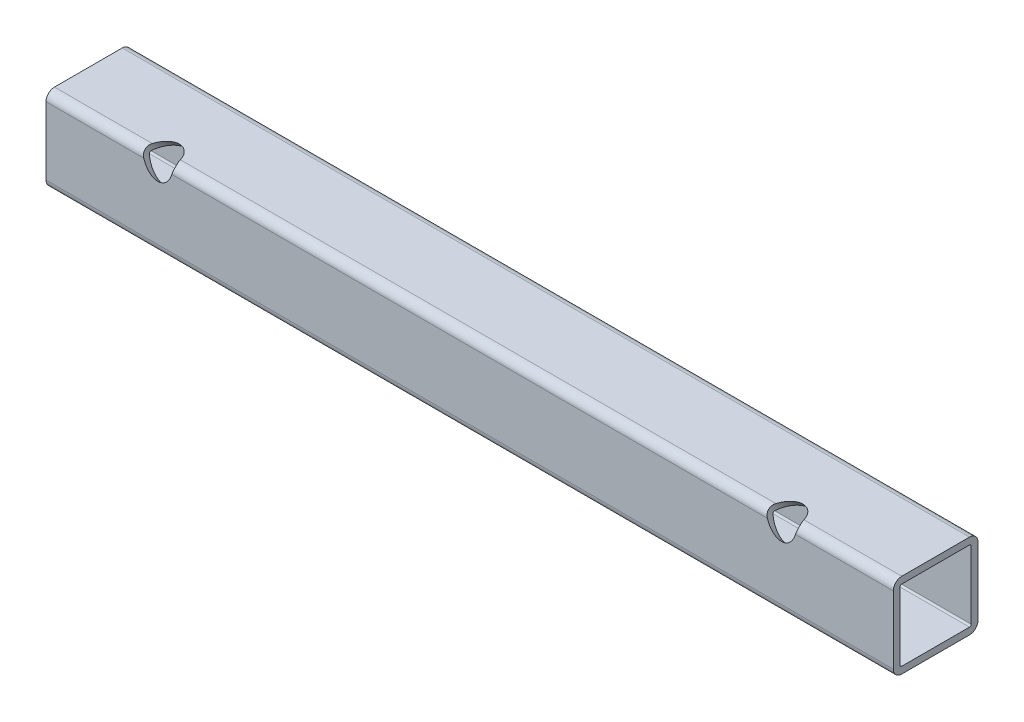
ISO-10303-21;
HEADER;
FILE_DESCRIPTION(('STEP AP214'),'2;1');
FILE_NAME('part.step','',(''),(''),'','','');
FILE_SCHEMA(('AUTOMOTIVE_DESIGN { 1 0 10303 214 1 1 1 1 }'));
ENDSEC;
DATA;
#1=APPLICATION_CONTEXT('core data for automotive mechanical design processes');
#2=APPLICATION_PROTOCOL_DEFINITION('international standard','automotive_design',2000,#1);
#3=PRODUCT_CONTEXT('',#1,'mechanical');
#4=PRODUCT('Part','Part','',(#3));
#5=PRODUCT_RELATED_PRODUCT_CATEGORY('part','',(#4));
#6=PRODUCT_DEFINITION_FORMATION('','',#4);
#7=PRODUCT_DEFINITION_CONTEXT('part definition',#1,'design');
#8=PRODUCT_DEFINITION('design','',#6,#7);
#9=PRODUCT_DEFINITION_SHAPE('','',#8);
#10=(LENGTH_UNIT() NAMED_UNIT(*) SI_UNIT(.MILLI.,.METRE.));
#11=(NAMED_UNIT(*) PLANE_ANGLE_UNIT() SI_UNIT($,.RADIAN.));
#12=(NAMED_UNIT(*) SI_UNIT($,.STERADIAN.) SOLID_ANGLE_UNIT());
#13=UNCERTAINTY_MEASURE_WITH_UNIT(LENGTH_MEASURE(1.E-05),#10,'distance_accuracy_value','');
#14=(GEOMETRIC_REPRESENTATION_CONTEXT(3) GLOBAL_UNCERTAINTY_ASSIGNED_CONTEXT((#13)) GLOBAL_UNIT_ASSIGNED_CONTEXT((#10,
#11,#12)) REPRESENTATION_CONTEXT('',''));
#15=CARTESIAN_POINT('',(0.,0.,0.));
#16=DIRECTION('',(0.,0.,1.));
#17=DIRECTION('',(1.,0.,0.));
#18=AXIS2_PLACEMENT_3D('',#15,#16,#17);
#19=CARTESIAN_POINT('',(125.,10.,10.));
#20=DIRECTION('',(-1.,0.,0.));
#21=DIRECTION('',(0.,0.,1.));
#22=AXIS2_PLACEMENT_3D('',#19,#20,#21);
#23=CYLINDRICAL_SURFACE('',#22,2.5);
#24=DIRECTION('',(-1.,0.,0.));
#25=VECTOR('',#24,1.);
#26=CARTESIAN_POINT('',(125.,12.5,9.99999999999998));
#27=LINE('',#26,#25);
#28=CARTESIAN_POINT('',(87.8617636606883,12.5,9.99999999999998));
#29=VERTEX_POINT('',#28);
#30=CARTESIAN_POINT('',(-87.8617636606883,12.5,9.99999999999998));
#31=VERTEX_POINT('',#30);
#32=EDGE_CURVE('E207',#29,#31,#27,.T.);
#33=ORIENTED_EDGE('',*,*,#32,.T.);
#34=CARTESIAN_POINT('',(-87.8617636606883,9.99999999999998,12.5));
#35=CARTESIAN_POINT('',(-87.8412157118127,10.0680174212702,12.4999928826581));
#36=CARTESIAN_POINT('',(-87.8208214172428,10.1360525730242,12.4972226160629));
#37=CARTESIAN_POINT('',(-87.7807816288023,10.2719220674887,12.4861052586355));
#38=CARTESIAN_POINT('',(-87.7611365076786,10.3397562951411,12.477755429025));
#39=CARTESIAN_POINT('',(-87.7038644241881,10.5430481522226,12.4441746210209));
#40=CARTESIAN_POINT('',(-87.6680741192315,10.6777409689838,12.4104114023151));
#41=CARTESIAN_POINT('',(-87.6048703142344,10.9418845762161,12.3200022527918));
#42=CARTESIAN_POINT('',(-87.5774868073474,11.071315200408,12.2632760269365));
#43=CARTESIAN_POINT('',(-87.5343029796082,11.3199405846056,12.1278395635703));
#44=CARTESIAN_POINT('',(-87.5184728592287,11.4391609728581,12.0491866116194));
#45=CARTESIAN_POINT('',(-87.5009833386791,11.6532294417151,11.879843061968));
#46=CARTESIAN_POINT('',(-87.4982058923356,11.7492971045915,11.7908063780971));
#47=CARTESIAN_POINT('',(-87.5040612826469,11.9261859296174,11.5990054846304));
#48=CARTESIAN_POINT('',(-87.512694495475,12.007006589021,11.4962408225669));
#49=CARTESIAN_POINT('',(-87.5397176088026,12.1472006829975,11.2863136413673));
#50=CARTESIAN_POINT('',(-87.557552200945,12.2075004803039,11.1796930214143));
#51=CARTESIAN_POINT('',(-87.6010903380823,12.3115054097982,10.9600700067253));
#52=CARTESIAN_POINT('',(-87.6268027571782,12.3551917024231,10.8470605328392));
#53=CARTESIAN_POINT('',(-87.6852974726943,12.4270619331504,10.612417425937));
#54=CARTESIAN_POINT('',(-87.7183334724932,12.4545093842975,10.4906213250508));
#55=CARTESIAN_POINT('',(-87.7706121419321,12.4818539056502,10.3069695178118));
#56=CARTESIAN_POINT('',(-87.7884721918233,12.4886643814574,10.2456578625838));
#57=CARTESIAN_POINT('',(-87.824768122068,12.4977341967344,10.1228923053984));
#58=CARTESIAN_POINT('',(-87.8432037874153,12.4999952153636,10.061438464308));
#59=CARTESIAN_POINT('',(-87.8617636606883,12.5,9.99999999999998));
#60=B_SPLINE_CURVE_WITH_KNOTS('',3,(#34,#35,#36,#37,#38,#39,#40,#41,#42,#43,#44,#45,#46,#47,#48,
#49,#50,#51,#52,#53,#54,#55,#56,#57,#58,#59),.UNSPECIFIED.,.F.,.F.,(4,2,2,2,2,2,2,2,2,2,2,2,4),
(0.,0.213047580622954,0.426199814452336,0.854225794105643,1.2837615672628,1.71218548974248,
2.10314834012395,2.49412407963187,2.86386745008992,3.23402886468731,3.6198976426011,
3.81242599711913,4.00488327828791),.UNSPECIFIED.);
#61=CARTESIAN_POINT('',(-87.8617636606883,9.99999999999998,12.5));
#62=VERTEX_POINT('',#61);
#63=EDGE_CURVE('E193',#62,#31,#60,.T.);
#64=ORIENTED_EDGE('',*,*,#63,.F.);
#65=DIRECTION('',(-1.,0.,0.));
#66=VECTOR('',#65,1.);
#67=CARTESIAN_POINT('',(125.,9.99999999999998,12.5));
#68=LINE('',#67,#66);
#69=CARTESIAN_POINT('',(87.8617636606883,9.99999999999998,12.5));
#70=VERTEX_POINT('',#69);
#71=EDGE_CURVE('E205',#70,#62,#68,.T.);
#72=ORIENTED_EDGE('',*,*,#71,.F.);
#73=CARTESIAN_POINT('',(87.8617636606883,12.5,9.99999999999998));
#74=CARTESIAN_POINT('',(87.8412157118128,12.4999928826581,10.0680174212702));
#75=CARTESIAN_POINT('',(87.8208214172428,12.4972226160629,10.1360525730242));
#76=CARTESIAN_POINT('',(87.7807816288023,12.4861052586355,10.2719220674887));
#77=CARTESIAN_POINT('',(87.7611365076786,12.477755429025,10.3397562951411));
#78=CARTESIAN_POINT('',(87.7038644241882,12.4441746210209,10.5430481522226));
#79=CARTESIAN_POINT('',(87.6680741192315,12.4104114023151,10.6777409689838));
#80=CARTESIAN_POINT('',(87.6048703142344,12.3200022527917,10.9418845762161));
#81=CARTESIAN_POINT('',(87.5774868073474,12.2632760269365,11.071315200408));
#82=CARTESIAN_POINT('',(87.5343029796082,12.1278395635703,11.3199405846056));
#83=CARTESIAN_POINT('',(87.5184728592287,12.0491866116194,11.4391609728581));
#84=CARTESIAN_POINT('',(87.5009833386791,11.879843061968,11.6532294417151));
#85=CARTESIAN_POINT('',(87.4982058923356,11.7908063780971,11.7492971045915));
#86=CARTESIAN_POINT('',(87.5040612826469,11.5990054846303,11.9261859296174));
#87=CARTESIAN_POINT('',(87.512694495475,11.4962408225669,12.007006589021));
#88=CARTESIAN_POINT('',(87.5397176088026,11.2863136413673,12.1472006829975));
#89=CARTESIAN_POINT('',(87.557552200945,11.1796930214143,12.2075004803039));
#90=CARTESIAN_POINT('',(87.6010903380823,10.9600700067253,12.3115054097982));
#91=CARTESIAN_POINT('',(87.6268027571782,10.8470605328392,12.3551917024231));
#92=CARTESIAN_POINT('',(87.6852974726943,10.612417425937,12.4270619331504));
#93=CARTESIAN_POINT('',(87.7183334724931,10.4906213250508,12.4545093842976));
#94=CARTESIAN_POINT('',(87.7706121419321,10.3069695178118,12.4818539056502));
#95=CARTESIAN_POINT('',(87.7884721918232,10.2456578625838,12.4886643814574));
#96=CARTESIAN_POINT('',(87.824768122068,10.1228923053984,12.4977341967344));
#97=CARTESIAN_POINT('',(87.8432037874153,10.061438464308,12.4999952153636));
#98=CARTESIAN_POINT('',(87.8617636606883,9.99999999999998,12.5));
#99=B_SPLINE_CURVE_WITH_KNOTS('',3,(#73,#74,#75,#76,#77,#78,#79,#80,#81,#82,#83,#84,#85,#86,#87,
#88,#89,#90,#91,#92,#93,#94,#95,#96,#97,#98),.UNSPECIFIED.,.F.,.F.,(4,2,2,2,2,2,2,2,2,2,2,2,4),
(0.,0.213047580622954,0.426199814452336,0.85422579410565,1.28376156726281,1.7121854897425,
2.10314834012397,2.49412407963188,2.86386745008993,3.23402886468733,3.6198976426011,
3.81242599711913,4.00488327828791),.UNSPECIFIED.);
#100=EDGE_CURVE('E400',#29,#70,#99,.T.);
#101=ORIENTED_EDGE('',*,*,#100,.F.);
#102=EDGE_LOOP('',(#33,#64,#72,#101));
#103=FACE_BOUND('',#102,.T.);
#104=ADVANCED_FACE('F32',(#103),#23,.T.);
#105=CARTESIAN_POINT('',(125.,10.,10.));
#106=DIRECTION('',(-1.,0.,0.));
#107=DIRECTION('',(0.,0.,1.));
#108=AXIS2_PLACEMENT_3D('',#105,#106,#107);
#109=CYLINDRICAL_SURFACE('',#108,0.5);
#110=CARTESIAN_POINT('',(-87.5139103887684,9.99999999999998,10.5));
#111=CARTESIAN_POINT('',(-87.5123413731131,10.0280963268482,10.5000230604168));
#112=CARTESIAN_POINT('',(-87.5107793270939,10.0561876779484,10.497633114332));
#113=CARTESIAN_POINT('',(-87.5078298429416,10.1115710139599,10.4881949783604));
#114=CARTESIAN_POINT('',(-87.5064423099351,10.1388634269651,10.4811493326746));
#115=CARTESIAN_POINT('',(-87.503999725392,10.191907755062,10.4625616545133));
#116=CARTESIAN_POINT('',(-87.5029448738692,10.2176587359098,10.4510169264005));
#117=CARTESIAN_POINT('',(-87.5012867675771,10.2668610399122,10.4237633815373));
#118=CARTESIAN_POINT('',(-87.5006833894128,10.2903129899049,10.4080557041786));
#119=CARTESIAN_POINT('',(-87.499997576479,10.3341624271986,10.3729887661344));
#120=CARTESIAN_POINT('',(-87.499913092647,10.3545716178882,10.3536441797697));
#121=CARTESIAN_POINT('',(-87.5002690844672,10.3918665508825,10.3118105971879));
#122=CARTESIAN_POINT('',(-87.5007096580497,10.4087516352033,10.2893210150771));
#123=CARTESIAN_POINT('',(-87.5020646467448,10.4384791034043,10.2419040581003));
#124=CARTESIAN_POINT('',(-87.5029779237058,10.4513310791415,10.2169826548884));
#125=CARTESIAN_POINT('',(-87.5051760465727,10.4726881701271,10.1653632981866));
#126=CARTESIAN_POINT('',(-87.5064607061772,10.4811954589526,10.1386662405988));
#127=CARTESIAN_POINT('',(-87.5087988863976,10.4915986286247,10.0931841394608));
#128=CARTESIAN_POINT('',(-87.5097902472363,10.4947474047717,10.0746724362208));
#129=CARTESIAN_POINT('',(-87.5118241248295,10.4989477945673,10.0374429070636));
#130=CARTESIAN_POINT('',(-87.5128665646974,10.5000024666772,10.0187254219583));
#131=CARTESIAN_POINT('',(-87.5139103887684,10.5,9.99999999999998));
#132=B_SPLINE_CURVE_WITH_KNOTS('',3,(#110,#111,#112,#113,#114,#115,#116,#117,#118,#119,#120,
#121,#122,#123,#124,#125,#126,#127,#128,#129,#130,#131),.UNSPECIFIED.,.F.,.F.,(4,2,2,2,2,2,2,2,
2,2,4),(0.,0.084311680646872,0.168577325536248,0.252893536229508,0.337186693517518,
0.421146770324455,0.50512250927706,0.588896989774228,0.672629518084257,0.728930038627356,
0.785148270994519),.UNSPECIFIED.);
#133=CARTESIAN_POINT('',(-87.5139103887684,9.99999999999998,10.5));
#134=VERTEX_POINT('',#133);
#135=CARTESIAN_POINT('',(-87.5139103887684,10.5,9.99999999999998));
#136=VERTEX_POINT('',#135);
#137=EDGE_CURVE('E429',#134,#136,#132,.T.);
#138=ORIENTED_EDGE('',*,*,#137,.T.);
#139=DIRECTION('',(-1.,0.,0.));
#140=VECTOR('',#139,1.);
#141=CARTESIAN_POINT('',(125.,10.5,9.99999999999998));
#142=LINE('',#141,#140);
#143=CARTESIAN_POINT('',(87.5139103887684,10.5,9.99999999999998));
#144=VERTEX_POINT('',#143);
#145=EDGE_CURVE('E320',#144,#136,#142,.T.);
#146=ORIENTED_EDGE('',*,*,#145,.F.);
#147=CARTESIAN_POINT('',(87.5139103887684,10.5,9.99999999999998));
#148=CARTESIAN_POINT('',(87.5123413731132,10.5000230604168,10.0280963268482));
#149=CARTESIAN_POINT('',(87.5107793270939,10.497633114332,10.0561876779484));
#150=CARTESIAN_POINT('',(87.5078298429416,10.4881949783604,10.1115710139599));
#151=CARTESIAN_POINT('',(87.5064423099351,10.4811493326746,10.1388634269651));
#152=CARTESIAN_POINT('',(87.503999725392,10.4625616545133,10.191907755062));
#153=CARTESIAN_POINT('',(87.5029448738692,10.4510169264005,10.2176587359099));
#154=CARTESIAN_POINT('',(87.5012867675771,10.4237633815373,10.2668610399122));
#155=CARTESIAN_POINT('',(87.5006833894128,10.4080557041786,10.2903129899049));
#156=CARTESIAN_POINT('',(87.499997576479,10.3729887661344,10.3341624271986));
#157=CARTESIAN_POINT('',(87.499913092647,10.3536441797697,10.3545716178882));
#158=CARTESIAN_POINT('',(87.5002690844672,10.3118105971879,10.3918665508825));
#159=CARTESIAN_POINT('',(87.5007096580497,10.2893210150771,10.4087516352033));
#160=CARTESIAN_POINT('',(87.5020646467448,10.2419040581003,10.4384791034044));
#161=CARTESIAN_POINT('',(87.5029779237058,10.2169826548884,10.4513310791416));
#162=CARTESIAN_POINT('',(87.5051760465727,10.1653632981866,10.4726881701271));
#163=CARTESIAN_POINT('',(87.5064607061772,10.1386662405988,10.4811954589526));
#164=CARTESIAN_POINT('',(87.5087988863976,10.0931841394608,10.4915986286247));
#165=CARTESIAN_POINT('',(87.5097902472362,10.0746724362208,10.4947474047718));
#166=CARTESIAN_POINT('',(87.5118241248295,10.0374429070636,10.4989477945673));
#167=CARTESIAN_POINT('',(87.5128665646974,10.0187254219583,10.5000024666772));
#168=CARTESIAN_POINT('',(87.5139103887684,9.99999999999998,10.5));
#169=B_SPLINE_CURVE_WITH_KNOTS('',3,(#147,#148,#149,#150,#151,#152,#153,#154,#155,#156,#157,
#158,#159,#160,#161,#162,#163,#164,#165,#166,#167,#168),.UNSPECIFIED.,.F.,.F.,(4,2,2,2,2,2,2,2,
2,2,4),(0.,0.084311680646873,0.168577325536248,0.252893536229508,0.337186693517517,
0.421146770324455,0.505122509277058,0.588896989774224,0.672629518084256,0.728930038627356,
0.785148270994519),.UNSPECIFIED.);
#170=CARTESIAN_POINT('',(87.5139103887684,9.99999999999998,10.5));
#171=VERTEX_POINT('',#170);
#172=EDGE_CURVE('E369',#144,#171,#169,.T.);
#173=ORIENTED_EDGE('',*,*,#172,.T.);
#174=DIRECTION('',(-1.,0.,0.));
#175=VECTOR('',#174,1.);
#176=CARTESIAN_POINT('',(125.,9.99999999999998,10.5));
#177=LINE('',#176,#175);
#178=EDGE_CURVE('E292',#171,#134,#177,.T.);
#179=ORIENTED_EDGE('',*,*,#178,.T.);
#180=EDGE_LOOP('',(#138,#146,#173,#179));
#181=FACE_BOUND('',#180,.T.);
#182=ADVANCED_FACE('F428',(#181),#109,.F.);
#183=CARTESIAN_POINT('',(125.,12.5,9.99999999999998));
#184=VERTEX_POINT('',#183);
#185=CARTESIAN_POINT('',(96.1382363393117,12.5,9.99999999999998));
#186=VERTEX_POINT('',#185);
#187=EDGE_CURVE('E221',#184,#186,#27,.T.);
#188=ORIENTED_EDGE('',*,*,#187,.T.);
#189=CARTESIAN_POINT('',(96.1382363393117,9.99999999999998,12.5));
#190=CARTESIAN_POINT('',(96.1587842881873,10.0680174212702,12.4999928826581));
#191=CARTESIAN_POINT('',(96.1791785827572,10.1360525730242,12.4972226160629));
#192=CARTESIAN_POINT('',(96.2192183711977,10.2719220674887,12.4861052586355));
#193=CARTESIAN_POINT('',(96.2388634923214,10.3397562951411,12.477755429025));
#194=CARTESIAN_POINT('',(96.2961355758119,10.5430481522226,12.4441746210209));
#195=CARTESIAN_POINT('',(96.3319258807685,10.6777409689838,12.4104114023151));
#196=CARTESIAN_POINT('',(96.3951296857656,10.9418845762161,12.3200022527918));
#197=CARTESIAN_POINT('',(96.4225131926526,11.071315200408,12.2632760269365));
#198=CARTESIAN_POINT('',(96.4656970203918,11.3199405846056,12.1278395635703));
#199=CARTESIAN_POINT('',(96.4815271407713,11.4391609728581,12.0491866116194));
#200=CARTESIAN_POINT('',(96.4990166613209,11.6532294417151,11.879843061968));
#201=CARTESIAN_POINT('',(96.5017941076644,11.7492971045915,11.7908063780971));
#202=CARTESIAN_POINT('',(96.4959387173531,11.9261859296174,11.5990054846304));
#203=CARTESIAN_POINT('',(96.487305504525,12.007006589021,11.4962408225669));
#204=CARTESIAN_POINT('',(96.4602823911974,12.1472006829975,11.2863136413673));
#205=CARTESIAN_POINT('',(96.442447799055,12.2075004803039,11.1796930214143));
#206=CARTESIAN_POINT('',(96.3989096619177,12.3115054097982,10.9600700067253));
#207=CARTESIAN_POINT('',(96.3731972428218,12.3551917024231,10.8470605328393));
#208=CARTESIAN_POINT('',(96.3147025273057,12.4270619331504,10.612417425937));
#209=CARTESIAN_POINT('',(96.2816665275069,12.4545093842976,10.4906213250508));
#210=CARTESIAN_POINT('',(96.2293878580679,12.4818539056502,10.3069695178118));
#211=CARTESIAN_POINT('',(96.2115278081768,12.4886643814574,10.2456578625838));
#212=CARTESIAN_POINT('',(96.175231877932,12.4977341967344,10.1228923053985));
#213=CARTESIAN_POINT('',(96.1567962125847,12.4999952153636,10.0614384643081));
#214=CARTESIAN_POINT('',(96.1382363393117,12.5,9.99999999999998));
#215=B_SPLINE_CURVE_WITH_KNOTS('',3,(#189,#190,#191,#192,#193,#194,#195,#196,#197,#198,#199,
#200,#201,#202,#203,#204,#205,#206,#207,#208,#209,#210,#211,#212,#213,#214),.UNSPECIFIED.,.F.,
.F.,(4,2,2,2,2,2,2,2,2,2,2,2,4),(0.,0.213047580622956,0.426199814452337,0.854225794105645,
1.2837615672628,1.71218548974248,2.10314834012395,2.49412407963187,2.86386745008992,
3.23402886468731,3.61989764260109,3.81242599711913,4.00488327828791),.UNSPECIFIED.);
#216=CARTESIAN_POINT('',(96.1382363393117,9.99999999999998,12.5));
#217=VERTEX_POINT('',#216);
#218=EDGE_CURVE('E394',#217,#186,#215,.T.);
#219=ORIENTED_EDGE('',*,*,#218,.F.);
#220=CARTESIAN_POINT('',(125.,9.99999999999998,12.5));
#221=VERTEX_POINT('',#220);
#222=EDGE_CURVE('E213',#221,#217,#68,.T.);
#223=ORIENTED_EDGE('',*,*,#222,.F.);
#224=CARTESIAN_POINT('',(125.,10.,10.));
#225=DIRECTION('',(1.,0.,0.));
#226=DIRECTION('',(0.,0.,-1.));
#227=AXIS2_PLACEMENT_3D('',#224,#225,#226);
#228=CIRCLE('',#227,2.5);
#229=EDGE_CURVE('E286',#184,#221,#228,.T.);
#230=ORIENTED_EDGE('',*,*,#229,.F.);
#231=EDGE_LOOP('',(#188,#219,#223,#230));
#232=FACE_BOUND('',#231,.T.);
#233=ADVANCED_FACE('F470',(#232),#23,.T.);
#234=CARTESIAN_POINT('',(96.4860896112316,9.99999999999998,10.5));
#235=CARTESIAN_POINT('',(96.4876586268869,10.0280963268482,10.5000230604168));
#236=CARTESIAN_POINT('',(96.4892206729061,10.0561876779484,10.497633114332));
#237=CARTESIAN_POINT('',(96.4921701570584,10.1115710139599,10.4881949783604));
#238=CARTESIAN_POINT('',(96.4935576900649,10.1388634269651,10.4811493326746));
#239=CARTESIAN_POINT('',(96.496000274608,10.191907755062,10.4625616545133));
#240=CARTESIAN_POINT('',(96.4970551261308,10.2176587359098,10.4510169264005));
#241=CARTESIAN_POINT('',(96.4987132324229,10.2668610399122,10.4237633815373));
#242=CARTESIAN_POINT('',(96.4993166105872,10.2903129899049,10.4080557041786));
#243=CARTESIAN_POINT('',(96.500002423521,10.3341624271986,10.3729887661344));
#244=CARTESIAN_POINT('',(96.500086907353,10.3545716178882,10.3536441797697));
#245=CARTESIAN_POINT('',(96.4997309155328,10.3918665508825,10.3118105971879));
#246=CARTESIAN_POINT('',(96.4992903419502,10.4087516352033,10.2893210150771));
#247=CARTESIAN_POINT('',(96.4979353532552,10.4384791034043,10.2419040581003));
#248=CARTESIAN_POINT('',(96.4970220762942,10.4513310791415,10.2169826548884));
#249=CARTESIAN_POINT('',(96.4948239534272,10.4726881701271,10.1653632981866));
#250=CARTESIAN_POINT('',(96.4935392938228,10.4811954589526,10.1386662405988));
#251=CARTESIAN_POINT('',(96.4912011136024,10.4915986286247,10.0931841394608));
#252=CARTESIAN_POINT('',(96.4902097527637,10.4947474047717,10.0746724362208));
#253=CARTESIAN_POINT('',(96.4881758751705,10.4989477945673,10.0374429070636));
#254=CARTESIAN_POINT('',(96.4871334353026,10.5000024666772,10.0187254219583));
#255=CARTESIAN_POINT('',(96.4860896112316,10.5,9.99999999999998));
#256=B_SPLINE_CURVE_WITH_KNOTS('',3,(#234,#235,#236,#237,#238,#239,#240,#241,#242,#243,#244,
#245,#246,#247,#248,#249,#250,#251,#252,#253,#254,#255),.UNSPECIFIED.,.F.,.F.,(4,2,2,2,2,2,2,2,
2,2,4),(0.,0.084311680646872,0.168577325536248,0.25289353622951,0.337186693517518,
0.421146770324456,0.50512250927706,0.588896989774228,0.672629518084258,0.728930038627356,
0.785148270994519),.UNSPECIFIED.);
#257=CARTESIAN_POINT('',(96.4860896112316,9.99999999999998,10.5));
#258=VERTEX_POINT('',#257);
#259=CARTESIAN_POINT('',(96.4860896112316,10.5,9.99999999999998));
#260=VERTEX_POINT('',#259);
#261=EDGE_CURVE('E377',#258,#260,#256,.T.);
#262=ORIENTED_EDGE('',*,*,#261,.T.);
#263=CARTESIAN_POINT('',(125.,10.5,9.99999999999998));
#264=VERTEX_POINT('',#263);
#265=EDGE_CURVE('E317',#264,#260,#142,.T.);
#266=ORIENTED_EDGE('',*,*,#265,.F.);
#267=CARTESIAN_POINT('',(125.,10.,10.));
#268=DIRECTION('',(1.,0.,0.));
#269=DIRECTION('',(0.,0.,-1.));
#270=AXIS2_PLACEMENT_3D('',#267,#268,#269);
#271=CIRCLE('',#270,0.5);
#272=CARTESIAN_POINT('',(125.,9.99999999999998,10.5));
#273=VERTEX_POINT('',#272);
#274=EDGE_CURVE('E325',#264,#273,#271,.T.);
#275=ORIENTED_EDGE('',*,*,#274,.T.);
#276=EDGE_CURVE('E276',#273,#258,#177,.T.);
#277=ORIENTED_EDGE('',*,*,#276,.T.);
#278=EDGE_LOOP('',(#262,#266,#275,#277));
#279=FACE_BOUND('',#278,.T.);
#280=ADVANCED_FACE('F410',(#279),#109,.F.);
#281=CARTESIAN_POINT('',(125.,-10.,10.));
#282=DIRECTION('',(1.,0.,0.));
#283=DIRECTION('',(0.,0.,-1.));
#284=AXIS2_PLACEMENT_3D('',#281,#282,#283);
#285=PLANE('',#284);
#286=CARTESIAN_POINT('',(125.,-10.,10.));
#287=DIRECTION('',(1.,0.,0.));
#288=DIRECTION('',(0.,0.,-1.));
#289=AXIS2_PLACEMENT_3D('',#286,#287,#288);
#290=CIRCLE('',#289,2.5);
#291=CARTESIAN_POINT('',(125.,-9.99999999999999,12.5));
#292=VERTEX_POINT('',#291);
#293=CARTESIAN_POINT('',(125.,-12.5,9.99999999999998));
#294=VERTEX_POINT('',#293);
#295=EDGE_CURVE('E264',#292,#294,#290,.T.);
#296=ORIENTED_EDGE('',*,*,#295,.T.);
#297=DIRECTION('',(0.,0.,-1.));
#298=VECTOR('',#297,1.);
#299=CARTESIAN_POINT('',(125.,-12.5,9.99999999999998));
#300=LINE('',#299,#298);
#301=CARTESIAN_POINT('',(125.,-12.5,-9.99999999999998));
#302=VERTEX_POINT('',#301);
#303=EDGE_CURVE('E269',#294,#302,#300,.T.);
#304=ORIENTED_EDGE('',*,*,#303,.T.);
#305=CARTESIAN_POINT('',(125.,-10.,-10.));
#306=DIRECTION('',(1.,0.,0.));
#307=DIRECTION('',(0.,0.,-1.));
#308=AXIS2_PLACEMENT_3D('',#305,#306,#307);
#309=CIRCLE('',#308,2.5);
#310=CARTESIAN_POINT('',(125.,-9.99999999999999,-12.5));
#311=VERTEX_POINT('',#310);
#312=EDGE_CURVE('E240',#302,#311,#309,.T.);
#313=ORIENTED_EDGE('',*,*,#312,.T.);
#314=DIRECTION('',(0.,1.,0.));
#315=VECTOR('',#314,1.);
#316=CARTESIAN_POINT('',(125.,9.99999999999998,-12.5));
#317=LINE('',#316,#315);
#318=CARTESIAN_POINT('',(125.,9.99999999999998,-12.5));
#319=VERTEX_POINT('',#318);
#320=EDGE_CURVE('E280',#311,#319,#317,.T.);
#321=ORIENTED_EDGE('',*,*,#320,.T.);
#322=CARTESIAN_POINT('',(125.,10.,-10.));
#323=DIRECTION('',(1.,0.,0.));
#324=DIRECTION('',(0.,0.,1.));
#325=AXIS2_PLACEMENT_3D('',#322,#323,#324);
#326=CIRCLE('',#325,2.5);
#327=CARTESIAN_POINT('',(125.,12.5,-9.99999999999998));
#328=VERTEX_POINT('',#327);
#329=EDGE_CURVE('E282',#319,#328,#326,.T.);
#330=ORIENTED_EDGE('',*,*,#329,.T.);
#331=DIRECTION('',(0.,0.,1.));
#332=VECTOR('',#331,1.);
#333=CARTESIAN_POINT('',(125.,12.5,9.99999999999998));
#334=LINE('',#333,#332);
#335=EDGE_CURVE('E284',#328,#184,#334,.T.);
#336=ORIENTED_EDGE('',*,*,#335,.T.);
#337=ORIENTED_EDGE('',*,*,#229,.T.);
#338=DIRECTION('',(0.,-1.,0.));
#339=VECTOR('',#338,1.);
#340=CARTESIAN_POINT('',(125.,9.99999999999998,12.5));
#341=LINE('',#340,#339);
#342=EDGE_CURVE('E288',#221,#292,#341,.T.);
#343=ORIENTED_EDGE('',*,*,#342,.T.);
#344=EDGE_LOOP('',(#296,#304,#313,#321,#330,#336,#337,#343));
#345=FACE_BOUND('',#344,.T.);
#346=DIRECTION('',(0.,-1.,0.));
#347=VECTOR('',#346,1.);
#348=CARTESIAN_POINT('',(125.,9.99999999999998,10.5));
#349=LINE('',#348,#347);
#350=CARTESIAN_POINT('',(125.,-10.,10.5));
#351=VERTEX_POINT('',#350);
#352=EDGE_CURVE('E361',#273,#351,#349,.T.);
#353=ORIENTED_EDGE('',*,*,#352,.F.);
#354=ORIENTED_EDGE('',*,*,#274,.F.);
#355=DIRECTION('',(0.,0.,1.));
#356=VECTOR('',#355,1.);
#357=CARTESIAN_POINT('',(125.,10.5,9.99999999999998));
#358=LINE('',#357,#356);
#359=CARTESIAN_POINT('',(125.,10.5,-9.99999999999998));
#360=VERTEX_POINT('',#359);
#361=EDGE_CURVE('E348',#360,#264,#358,.T.);
#362=ORIENTED_EDGE('',*,*,#361,.F.);
#363=CARTESIAN_POINT('',(125.,10.,-10.));
#364=DIRECTION('',(1.,0.,0.));
#365=DIRECTION('',(0.,0.,1.));
#366=AXIS2_PLACEMENT_3D('',#363,#364,#365);
#367=CIRCLE('',#366,0.5);
#368=CARTESIAN_POINT('',(125.,9.99999999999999,-10.5));
#369=VERTEX_POINT('',#368);
#370=EDGE_CURVE('E350',#369,#360,#367,.T.);
#371=ORIENTED_EDGE('',*,*,#370,.F.);
#372=DIRECTION('',(0.,1.,0.));
#373=VECTOR('',#372,1.);
#374=CARTESIAN_POINT('',(125.,9.99999999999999,-10.5));
#375=LINE('',#374,#373);
#376=CARTESIAN_POINT('',(125.,-9.99999999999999,-10.5));
#377=VERTEX_POINT('',#376);
#378=EDGE_CURVE('E353',#377,#369,#375,.T.);
#379=ORIENTED_EDGE('',*,*,#378,.F.);
#380=CARTESIAN_POINT('',(125.,-10.,-10.));
#381=DIRECTION('',(1.,0.,0.));
#382=DIRECTION('',(0.,0.,-1.));
#383=AXIS2_PLACEMENT_3D('',#380,#381,#382);
#384=CIRCLE('',#383,0.499999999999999);
#385=CARTESIAN_POINT('',(125.,-10.5,-10.));
#386=VERTEX_POINT('',#385);
#387=EDGE_CURVE('E355',#386,#377,#384,.T.);
#388=ORIENTED_EDGE('',*,*,#387,.F.);
#389=DIRECTION('',(0.,0.,-1.));
#390=VECTOR('',#389,1.);
#391=CARTESIAN_POINT('',(125.,-10.5,9.99999999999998));
#392=LINE('',#391,#390);
#393=CARTESIAN_POINT('',(125.,-10.5,9.99999999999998));
#394=VERTEX_POINT('',#393);
#395=EDGE_CURVE('E357',#394,#386,#392,.T.);
#396=ORIENTED_EDGE('',*,*,#395,.F.);
#397=CARTESIAN_POINT('',(125.,-10.,10.));
#398=DIRECTION('',(1.,0.,0.));
#399=DIRECTION('',(0.,0.,-1.));
#400=AXIS2_PLACEMENT_3D('',#397,#398,#399);
#401=CIRCLE('',#400,0.5);
#402=EDGE_CURVE('E359',#351,#394,#401,.T.);
#403=ORIENTED_EDGE('',*,*,#402,.F.);
#404=EDGE_LOOP('',(#353,#354,#362,#371,#379,#388,#396,#403));
#405=FACE_BOUND('',#404,.T.);
#406=ADVANCED_FACE('F419',(#345,#405),#285,.T.);
#407=CARTESIAN_POINT('',(-125.,-10.,10.));
#408=DIRECTION('',(1.,0.,0.));
#409=DIRECTION('',(0.,0.,-1.));
#410=AXIS2_PLACEMENT_3D('',#407,#408,#409);
#411=PLANE('',#410);
#412=CARTESIAN_POINT('',(-125.,-10.,10.));
#413=DIRECTION('',(1.,0.,0.));
#414=DIRECTION('',(0.,0.,-1.));
#415=AXIS2_PLACEMENT_3D('',#412,#413,#414);
#416=CIRCLE('',#415,2.5);
#417=CARTESIAN_POINT('',(-125.,-9.99999999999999,12.5));
#418=VERTEX_POINT('',#417);
#419=CARTESIAN_POINT('',(-125.,-12.5,9.99999999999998));
#420=VERTEX_POINT('',#419);
#421=EDGE_CURVE('E253',#418,#420,#416,.T.);
#422=ORIENTED_EDGE('',*,*,#421,.F.);
#423=DIRECTION('',(0.,-1.,0.));
#424=VECTOR('',#423,1.);
#425=CARTESIAN_POINT('',(-125.,9.99999999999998,12.5));
#426=LINE('',#425,#424);
#427=CARTESIAN_POINT('',(-125.,9.99999999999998,12.5));
#428=VERTEX_POINT('',#427);
#429=EDGE_CURVE('E263',#428,#418,#426,.T.);
#430=ORIENTED_EDGE('',*,*,#429,.F.);
#431=CARTESIAN_POINT('',(-125.,10.,10.));
#432=DIRECTION('',(1.,0.,0.));
#433=DIRECTION('',(0.,0.,-1.));
#434=AXIS2_PLACEMENT_3D('',#431,#432,#433);
#435=CIRCLE('',#434,2.5);
#436=CARTESIAN_POINT('',(-125.,12.5,9.99999999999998));
#437=VERTEX_POINT('',#436);
#438=EDGE_CURVE('E261',#437,#428,#435,.T.);
#439=ORIENTED_EDGE('',*,*,#438,.F.);
#440=DIRECTION('',(0.,0.,1.));
#441=VECTOR('',#440,1.);
#442=CARTESIAN_POINT('',(-125.,12.5,9.99999999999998));
#443=LINE('',#442,#441);
#444=CARTESIAN_POINT('',(-125.,12.5,-9.99999999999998));
#445=VERTEX_POINT('',#444);
#446=EDGE_CURVE('E258',#445,#437,#443,.T.);
#447=ORIENTED_EDGE('',*,*,#446,.F.);
#448=CARTESIAN_POINT('',(-125.,10.,-10.));
#449=DIRECTION('',(1.,0.,0.));
#450=DIRECTION('',(0.,0.,1.));
#451=AXIS2_PLACEMENT_3D('',#448,#449,#450);
#452=CIRCLE('',#451,2.5);
#453=CARTESIAN_POINT('',(-125.,9.99999999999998,-12.5));
#454=VERTEX_POINT('',#453);
#455=EDGE_CURVE('E251',#454,#445,#452,.T.);
#456=ORIENTED_EDGE('',*,*,#455,.F.);
#457=DIRECTION('',(0.,1.,0.));
#458=VECTOR('',#457,1.);
#459=CARTESIAN_POINT('',(-125.,9.99999999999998,-12.5));
#460=LINE('',#459,#458);
#461=CARTESIAN_POINT('',(-125.,-9.99999999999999,-12.5));
#462=VERTEX_POINT('',#461);
#463=EDGE_CURVE('E249',#462,#454,#460,.T.);
#464=ORIENTED_EDGE('',*,*,#463,.F.);
#465=CARTESIAN_POINT('',(-125.,-10.,-10.));
#466=DIRECTION('',(1.,0.,0.));
#467=DIRECTION('',(0.,0.,-1.));
#468=AXIS2_PLACEMENT_3D('',#465,#466,#467);
#469=CIRCLE('',#468,2.5);
#470=CARTESIAN_POINT('',(-125.,-12.5,-9.99999999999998));
#471=VERTEX_POINT('',#470);
#472=EDGE_CURVE('E239',#471,#462,#469,.T.);
#473=ORIENTED_EDGE('',*,*,#472,.F.);
#474=DIRECTION('',(0.,0.,-1.));
#475=VECTOR('',#474,1.);
#476=CARTESIAN_POINT('',(-125.,-12.5,9.99999999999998));
#477=LINE('',#476,#475);
#478=EDGE_CURVE('E247',#420,#471,#477,.T.);
#479=ORIENTED_EDGE('',*,*,#478,.F.);
#480=EDGE_LOOP('',(#422,#430,#439,#447,#456,#464,#473,#479));
#481=FACE_BOUND('',#480,.T.);
#482=CARTESIAN_POINT('',(-125.,10.,10.));
#483=DIRECTION('',(1.,0.,0.));
#484=DIRECTION('',(0.,0.,-1.));
#485=AXIS2_PLACEMENT_3D('',#482,#483,#484);
#486=CIRCLE('',#485,0.5);
#487=CARTESIAN_POINT('',(-125.,10.5,9.99999999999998));
#488=VERTEX_POINT('',#487);
#489=CARTESIAN_POINT('',(-125.,9.99999999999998,10.5));
#490=VERTEX_POINT('',#489);
#491=EDGE_CURVE('E344',#488,#490,#486,.T.);
#492=ORIENTED_EDGE('',*,*,#491,.T.);
#493=DIRECTION('',(0.,-1.,0.));
#494=VECTOR('',#493,1.);
#495=CARTESIAN_POINT('',(-125.,9.99999999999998,10.5));
#496=LINE('',#495,#494);
#497=CARTESIAN_POINT('',(-125.,-10.,10.5));
#498=VERTEX_POINT('',#497);
#499=EDGE_CURVE('E341',#490,#498,#496,.T.);
#500=ORIENTED_EDGE('',*,*,#499,.T.);
#501=CARTESIAN_POINT('',(-125.,-10.,10.));
#502=DIRECTION('',(1.,0.,0.));
#503=DIRECTION('',(0.,0.,-1.));
#504=AXIS2_PLACEMENT_3D('',#501,#502,#503);
#505=CIRCLE('',#504,0.5);
#506=CARTESIAN_POINT('',(-125.,-10.5,9.99999999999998));
#507=VERTEX_POINT('',#506);
#508=EDGE_CURVE('E338',#498,#507,#505,.T.);
#509=ORIENTED_EDGE('',*,*,#508,.T.);
#510=DIRECTION('',(0.,0.,-1.));
#511=VECTOR('',#510,1.);
#512=CARTESIAN_POINT('',(-125.,-10.5,9.99999999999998));
#513=LINE('',#512,#511);
#514=CARTESIAN_POINT('',(-125.,-10.5,-10.));
#515=VERTEX_POINT('',#514);
#516=EDGE_CURVE('E335',#507,#515,#513,.T.);
#517=ORIENTED_EDGE('',*,*,#516,.T.);
#518=CARTESIAN_POINT('',(-125.,-10.,-10.));
#519=DIRECTION('',(1.,0.,0.));
#520=DIRECTION('',(0.,0.,-1.));
#521=AXIS2_PLACEMENT_3D('',#518,#519,#520);
#522=CIRCLE('',#521,0.499999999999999);
#523=CARTESIAN_POINT('',(-125.,-9.99999999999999,-10.5));
#524=VERTEX_POINT('',#523);
#525=EDGE_CURVE('E332',#515,#524,#522,.T.);
#526=ORIENTED_EDGE('',*,*,#525,.T.);
#527=DIRECTION('',(0.,1.,0.));
#528=VECTOR('',#527,1.);
#529=CARTESIAN_POINT('',(-125.,9.99999999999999,-10.5));
#530=LINE('',#529,#528);
#531=CARTESIAN_POINT('',(-125.,9.99999999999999,-10.5));
#532=VERTEX_POINT('',#531);
#533=EDGE_CURVE('E329',#524,#532,#530,.T.);
#534=ORIENTED_EDGE('',*,*,#533,.T.);
#535=CARTESIAN_POINT('',(-125.,10.,-10.));
#536=DIRECTION('',(1.,0.,0.));
#537=DIRECTION('',(0.,0.,1.));
#538=AXIS2_PLACEMENT_3D('',#535,#536,#537);
#539=CIRCLE('',#538,0.5);
#540=CARTESIAN_POINT('',(-125.,10.5,-9.99999999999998));
#541=VERTEX_POINT('',#540);
#542=EDGE_CURVE('E326',#532,#541,#539,.T.);
#543=ORIENTED_EDGE('',*,*,#542,.T.);
#544=DIRECTION('',(0.,0.,1.));
#545=VECTOR('',#544,1.);
#546=CARTESIAN_POINT('',(-125.,10.5,9.99999999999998));
#547=LINE('',#546,#545);
#548=EDGE_CURVE('E322',#541,#488,#547,.T.);
#549=ORIENTED_EDGE('',*,*,#548,.T.);
#550=EDGE_LOOP('',(#492,#500,#509,#517,#526,#534,#543,#549));
#551=FACE_BOUND('',#550,.T.);
#552=ADVANCED_FACE('F245',(#481,#551),#411,.F.);
#553=CARTESIAN_POINT('',(125.,-10.,10.));
#554=DIRECTION('',(-1.,0.,0.));
#555=DIRECTION('',(0.,0.,1.));
#556=AXIS2_PLACEMENT_3D('',#553,#554,#555);
#557=CYLINDRICAL_SURFACE('',#556,2.5);
#558=ORIENTED_EDGE('',*,*,#421,.T.);
#559=DIRECTION('',(-1.,0.,0.));
#560=VECTOR('',#559,1.);
#561=CARTESIAN_POINT('',(125.,-12.5,9.99999999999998));
#562=LINE('',#561,#560);
#563=EDGE_CURVE('E11',#294,#420,#562,.T.);
#564=ORIENTED_EDGE('',*,*,#563,.F.);
#565=ORIENTED_EDGE('',*,*,#295,.F.);
#566=DIRECTION('',(-1.,0.,0.));
#567=VECTOR('',#566,1.);
#568=CARTESIAN_POINT('',(125.,-9.99999999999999,12.5));
#569=LINE('',#568,#567);
#570=EDGE_CURVE('E217',#292,#418,#569,.T.);
#571=ORIENTED_EDGE('',*,*,#570,.T.);
#572=EDGE_LOOP('',(#558,#564,#565,#571));
#573=FACE_BOUND('',#572,.T.);
#574=ADVANCED_FACE('F34',(#573),#557,.T.);
#575=CARTESIAN_POINT('',(125.,-12.5,9.99999999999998));
#576=DIRECTION('',(0.,1.,0.));
#577=DIRECTION('',(0.,0.,1.));
#578=AXIS2_PLACEMENT_3D('',#575,#576,#577);
#579=PLANE('',#578);
#580=ORIENTED_EDGE('',*,*,#478,.T.);
#581=DIRECTION('',(-1.,0.,0.));
#582=VECTOR('',#581,1.);
#583=CARTESIAN_POINT('',(125.,-12.5,-9.99999999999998));
#584=LINE('',#583,#582);
#585=EDGE_CURVE('E40',#302,#471,#584,.T.);
#586=ORIENTED_EDGE('',*,*,#585,.F.);
#587=ORIENTED_EDGE('',*,*,#303,.F.);
#588=ORIENTED_EDGE('',*,*,#563,.T.);
#589=EDGE_LOOP('',(#580,#586,#587,#588));
#590=FACE_BOUND('',#589,.T.);
#591=ADVANCED_FACE('F649',(#590),#579,.F.);
#592=CARTESIAN_POINT('',(125.,-10.,-10.));
#593=DIRECTION('',(-1.,0.,0.));
#594=DIRECTION('',(0.,0.,1.));
#595=AXIS2_PLACEMENT_3D('',#592,#593,#594);
#596=CYLINDRICAL_SURFACE('',#595,2.5);
#597=ORIENTED_EDGE('',*,*,#472,.T.);
#598=DIRECTION('',(-1.,0.,0.));
#599=VECTOR('',#598,1.);
#600=CARTESIAN_POINT('',(125.,-9.99999999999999,-12.5));
#601=LINE('',#600,#599);
#602=EDGE_CURVE('E230',#311,#462,#601,.T.);
#603=ORIENTED_EDGE('',*,*,#602,.F.);
#604=ORIENTED_EDGE('',*,*,#312,.F.);
#605=ORIENTED_EDGE('',*,*,#585,.T.);
#606=EDGE_LOOP('',(#597,#603,#604,#605));
#607=FACE_BOUND('',#606,.T.);
#608=ADVANCED_FACE('F237',(#607),#596,.T.);
#609=CARTESIAN_POINT('',(125.,9.99999999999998,-12.5));
#610=DIRECTION('',(0.,0.,1.));
#611=DIRECTION('',(0.,-1.,0.));
#612=AXIS2_PLACEMENT_3D('',#609,#610,#611);
#613=PLANE('',#612);
#614=ORIENTED_EDGE('',*,*,#463,.T.);
#615=DIRECTION('',(-1.,0.,0.));
#616=VECTOR('',#615,1.);
#617=CARTESIAN_POINT('',(125.,9.99999999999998,-12.5));
#618=LINE('',#617,#616);
#619=EDGE_CURVE('E227',#319,#454,#618,.T.);
#620=ORIENTED_EDGE('',*,*,#619,.F.);
#621=ORIENTED_EDGE('',*,*,#320,.F.);
#622=ORIENTED_EDGE('',*,*,#602,.T.);
#623=EDGE_LOOP('',(#614,#620,#621,#622));
#624=FACE_BOUND('',#623,.T.);
#625=ADVANCED_FACE('F631',(#624),#613,.F.);
#626=CARTESIAN_POINT('',(125.,10.,-10.));
#627=DIRECTION('',(-1.,0.,0.));
#628=DIRECTION('',(0.,0.,1.));
#629=AXIS2_PLACEMENT_3D('',#626,#627,#628);
#630=CYLINDRICAL_SURFACE('',#629,2.5);
#631=ORIENTED_EDGE('',*,*,#455,.T.);
#632=DIRECTION('',(-1.,0.,0.));
#633=VECTOR('',#632,1.);
#634=CARTESIAN_POINT('',(125.,12.5,-9.99999999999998));
#635=LINE('',#634,#633);
#636=EDGE_CURVE('E224',#328,#445,#635,.T.);
#637=ORIENTED_EDGE('',*,*,#636,.F.);
#638=ORIENTED_EDGE('',*,*,#329,.F.);
#639=ORIENTED_EDGE('',*,*,#619,.T.);
#640=EDGE_LOOP('',(#631,#637,#638,#639));
#641=FACE_BOUND('',#640,.T.);
#642=ADVANCED_FACE('F501',(#641),#630,.T.);
#643=CARTESIAN_POINT('',(125.,12.5,9.99999999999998));
#644=DIRECTION('',(0.,-1.,0.));
#645=DIRECTION('',(0.,0.,-1.));
#646=AXIS2_PLACEMENT_3D('',#643,#644,#645);
#647=PLANE('',#646);
#648=CARTESIAN_POINT('',(-96.1382363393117,12.5,9.99999999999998));
#649=VERTEX_POINT('',#648);
#650=EDGE_CURVE('E216',#649,#437,#27,.T.);
#651=ORIENTED_EDGE('',*,*,#650,.F.);
#652=CARTESIAN_POINT('',(-92.,12.5,12.5000000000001));
#653=DIRECTION('',(0.,-1.,0.));
#654=DIRECTION('',(0.,0.,1.));
#655=AXIS2_PLACEMENT_3D('',#652,#653,#654);
#656=ELLIPSE('',#655,6.36396103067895,4.5);
#657=EDGE_CURVE('E198',#31,#649,#656,.F.);
#658=ORIENTED_EDGE('',*,*,#657,.F.);
#659=ORIENTED_EDGE('',*,*,#32,.F.);
#660=CARTESIAN_POINT('',(92.,12.5,12.5));
#661=DIRECTION('',(0.,-1.,0.));
#662=DIRECTION('',(0.,0.,1.));
#663=AXIS2_PLACEMENT_3D('',#660,#661,#662);
#664=ELLIPSE('',#663,6.36396103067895,4.5);
#665=EDGE_CURVE('E347',#186,#29,#664,.F.);
#666=ORIENTED_EDGE('',*,*,#665,.F.);
#667=ORIENTED_EDGE('',*,*,#187,.F.);
#668=ORIENTED_EDGE('',*,*,#335,.F.);
#669=ORIENTED_EDGE('',*,*,#636,.T.);
#670=ORIENTED_EDGE('',*,*,#446,.T.);
#671=EDGE_LOOP('',(#651,#658,#659,#666,#667,#668,#669,#670));
#672=FACE_BOUND('',#671,.T.);
#673=ADVANCED_FACE('F467',(#672),#647,.F.);
#674=CARTESIAN_POINT('',(-96.1382363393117,9.99999999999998,12.5));
#675=VERTEX_POINT('',#674);
#676=EDGE_CURVE('E214',#675,#428,#68,.T.);
#677=ORIENTED_EDGE('',*,*,#676,.F.);
#678=CARTESIAN_POINT('',(-96.1382363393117,12.5,9.99999999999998));
#679=CARTESIAN_POINT('',(-96.1587842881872,12.4999928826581,10.0680174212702));
#680=CARTESIAN_POINT('',(-96.1791785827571,12.4972226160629,10.1360525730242));
#681=CARTESIAN_POINT('',(-96.2192183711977,12.4861052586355,10.2719220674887));
#682=CARTESIAN_POINT('',(-96.2388634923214,12.477755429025,10.3397562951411));
#683=CARTESIAN_POINT('',(-96.2961355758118,12.4441746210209,10.5430481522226));
#684=CARTESIAN_POINT('',(-96.3319258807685,12.4104114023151,10.6777409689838));
#685=CARTESIAN_POINT('',(-96.3951296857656,12.3200022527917,10.9418845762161));
#686=CARTESIAN_POINT('',(-96.4225131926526,12.2632760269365,11.071315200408));
#687=CARTESIAN_POINT('',(-96.4656970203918,12.1278395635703,11.3199405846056));
#688=CARTESIAN_POINT('',(-96.4815271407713,12.0491866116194,11.4391609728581));
#689=CARTESIAN_POINT('',(-96.4990166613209,11.879843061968,11.6532294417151));
#690=CARTESIAN_POINT('',(-96.5017941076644,11.7908063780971,11.7492971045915));
#691=CARTESIAN_POINT('',(-96.4959387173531,11.5990054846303,11.9261859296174));
#692=CARTESIAN_POINT('',(-96.487305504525,11.4962408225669,12.007006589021));
#693=CARTESIAN_POINT('',(-96.4602823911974,11.2863136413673,12.1472006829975));
#694=CARTESIAN_POINT('',(-96.442447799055,11.1796930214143,12.2075004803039));
#695=CARTESIAN_POINT('',(-96.3989096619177,10.9600700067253,12.3115054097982));
#696=CARTESIAN_POINT('',(-96.3731972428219,10.8470605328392,12.3551917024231));
#697=CARTESIAN_POINT('',(-96.3147025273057,10.612417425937,12.4270619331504));
#698=CARTESIAN_POINT('',(-96.2816665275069,10.4906213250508,12.4545093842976));
#699=CARTESIAN_POINT('',(-96.2293878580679,10.3069695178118,12.4818539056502));
#700=CARTESIAN_POINT('',(-96.2115278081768,10.2456578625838,12.4886643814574));
#701=CARTESIAN_POINT('',(-96.175231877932,10.1228923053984,12.4977341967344));
#702=CARTESIAN_POINT('',(-96.1567962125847,10.061438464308,12.4999952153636));
#703=CARTESIAN_POINT('',(-96.1382363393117,9.99999999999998,12.5));
#704=B_SPLINE_CURVE_WITH_KNOTS('',3,(#678,#679,#680,#681,#682,#683,#684,#685,#686,#687,#688,
#689,#690,#691,#692,#693,#694,#695,#696,#697,#698,#699,#700,#701,#702,#703),.UNSPECIFIED.,.F.,
.F.,(4,2,2,2,2,2,2,2,2,2,2,2,4),(0.,0.213047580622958,0.42619981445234,0.854225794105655,
1.28376156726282,1.7121854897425,2.10314834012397,2.49412407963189,2.86386745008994,
3.23402886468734,3.61989764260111,3.81242599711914,4.00488327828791),.UNSPECIFIED.);
#705=EDGE_CURVE('E47',#649,#675,#704,.T.);
#706=ORIENTED_EDGE('',*,*,#705,.F.);
#707=ORIENTED_EDGE('',*,*,#650,.T.);
#708=ORIENTED_EDGE('',*,*,#438,.T.);
#709=EDGE_LOOP('',(#677,#706,#707,#708));
#710=FACE_BOUND('',#709,.T.);
#711=ADVANCED_FACE('F478',(#710),#23,.T.);
#712=CARTESIAN_POINT('',(125.,9.99999999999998,12.5));
#713=DIRECTION('',(0.,0.,-1.));
#714=DIRECTION('',(0.,1.,0.));
#715=AXIS2_PLACEMENT_3D('',#712,#713,#714);
#716=PLANE('',#715);
#717=ORIENTED_EDGE('',*,*,#71,.T.);
#718=CARTESIAN_POINT('',(-92.,12.4999999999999,12.5));
#719=DIRECTION('',(0.,0.,-1.));
#720=DIRECTION('',(0.,1.,0.));
#721=AXIS2_PLACEMENT_3D('',#718,#719,#720);
#722=ELLIPSE('',#721,6.36396103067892,4.5);
#723=EDGE_CURVE('E190',#675,#62,#722,.F.);
#724=ORIENTED_EDGE('',*,*,#723,.F.);
#725=ORIENTED_EDGE('',*,*,#676,.T.);
#726=ORIENTED_EDGE('',*,*,#429,.T.);
#727=ORIENTED_EDGE('',*,*,#570,.F.);
#728=ORIENTED_EDGE('',*,*,#342,.F.);
#729=ORIENTED_EDGE('',*,*,#222,.T.);
#730=CARTESIAN_POINT('',(92.,12.5,12.5));
#731=DIRECTION('',(0.,0.,-1.));
#732=DIRECTION('',(0.,1.,0.));
#733=AXIS2_PLACEMENT_3D('',#730,#731,#732);
#734=ELLIPSE('',#733,6.36396103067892,4.5);
#735=EDGE_CURVE('E212',#70,#217,#734,.F.);
#736=ORIENTED_EDGE('',*,*,#735,.F.);
#737=EDGE_LOOP('',(#717,#724,#725,#726,#727,#728,#729,#736));
#738=FACE_BOUND('',#737,.T.);
#739=ADVANCED_FACE('F210',(#738),#716,.F.);
#740=CARTESIAN_POINT('',(-96.4860896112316,10.5,9.99999999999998));
#741=CARTESIAN_POINT('',(-96.4876586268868,10.5000230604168,10.0280963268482));
#742=CARTESIAN_POINT('',(-96.4892206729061,10.497633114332,10.0561876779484));
#743=CARTESIAN_POINT('',(-96.4921701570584,10.4881949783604,10.1115710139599));
#744=CARTESIAN_POINT('',(-96.4935576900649,10.4811493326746,10.1388634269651));
#745=CARTESIAN_POINT('',(-96.496000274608,10.4625616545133,10.191907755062));
#746=CARTESIAN_POINT('',(-96.4970551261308,10.4510169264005,10.2176587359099));
#747=CARTESIAN_POINT('',(-96.4987132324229,10.4237633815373,10.2668610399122));
#748=CARTESIAN_POINT('',(-96.4993166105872,10.4080557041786,10.2903129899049));
#749=CARTESIAN_POINT('',(-96.500002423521,10.3729887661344,10.3341624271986));
#750=CARTESIAN_POINT('',(-96.500086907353,10.3536441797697,10.3545716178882));
#751=CARTESIAN_POINT('',(-96.4997309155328,10.3118105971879,10.3918665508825));
#752=CARTESIAN_POINT('',(-96.4992903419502,10.2893210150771,10.4087516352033));
#753=CARTESIAN_POINT('',(-96.4979353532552,10.2419040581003,10.4384791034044));
#754=CARTESIAN_POINT('',(-96.4970220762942,10.2169826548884,10.4513310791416));
#755=CARTESIAN_POINT('',(-96.4948239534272,10.1653632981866,10.4726881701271));
#756=CARTESIAN_POINT('',(-96.4935392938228,10.1386662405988,10.4811954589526));
#757=CARTESIAN_POINT('',(-96.4912011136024,10.0931841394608,10.4915986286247));
#758=CARTESIAN_POINT('',(-96.4902097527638,10.0746724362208,10.4947474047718));
#759=CARTESIAN_POINT('',(-96.4881758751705,10.0374429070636,10.4989477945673));
#760=CARTESIAN_POINT('',(-96.4871334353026,10.0187254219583,10.5000024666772));
#761=CARTESIAN_POINT('',(-96.4860896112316,9.99999999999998,10.5));
#762=B_SPLINE_CURVE_WITH_KNOTS('',3,(#740,#741,#742,#743,#744,#745,#746,#747,#748,#749,#750,
#751,#752,#753,#754,#755,#756,#757,#758,#759,#760,#761),.UNSPECIFIED.,.F.,.F.,(4,2,2,2,2,2,2,2,
2,2,4),(0.,0.084311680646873,0.168577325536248,0.25289353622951,0.337186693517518,
0.421146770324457,0.505122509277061,0.588896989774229,0.672629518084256,0.728930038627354,
0.78514827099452),.UNSPECIFIED.);
#763=CARTESIAN_POINT('',(-96.4860896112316,10.5,9.99999999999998));
#764=VERTEX_POINT('',#763);
#765=CARTESIAN_POINT('',(-96.4860896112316,9.99999999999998,10.5));
#766=VERTEX_POINT('',#765);
#767=EDGE_CURVE('E55',#764,#766,#762,.T.);
#768=ORIENTED_EDGE('',*,*,#767,.T.);
#769=EDGE_CURVE('E293',#766,#490,#177,.T.);
#770=ORIENTED_EDGE('',*,*,#769,.T.);
#771=ORIENTED_EDGE('',*,*,#491,.F.);
#772=EDGE_CURVE('E321',#764,#488,#142,.T.);
#773=ORIENTED_EDGE('',*,*,#772,.F.);
#774=EDGE_LOOP('',(#768,#770,#771,#773));
#775=FACE_BOUND('',#774,.T.);
#776=ADVANCED_FACE('F432',(#775),#109,.F.);
#777=CARTESIAN_POINT('',(125.,9.99999999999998,10.5));
#778=DIRECTION('',(0.,0.,-1.));
#779=DIRECTION('',(0.,1.,0.));
#780=AXIS2_PLACEMENT_3D('',#777,#778,#779);
#781=PLANE('',#780);
#782=CARTESIAN_POINT('',(-92.,10.4999999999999,10.5));
#783=DIRECTION('',(0.,0.,-1.));
#784=DIRECTION('',(0.,1.,0.));
#785=AXIS2_PLACEMENT_3D('',#782,#783,#784);
#786=ELLIPSE('',#785,6.36396103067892,4.5);
#787=EDGE_CURVE('E199',#766,#134,#786,.F.);
#788=ORIENTED_EDGE('',*,*,#787,.T.);
#789=ORIENTED_EDGE('',*,*,#178,.F.);
#790=CARTESIAN_POINT('',(92.,10.5,10.5));
#791=DIRECTION('',(0.,0.,-1.));
#792=DIRECTION('',(0.,1.,0.));
#793=AXIS2_PLACEMENT_3D('',#790,#791,#792);
#794=ELLIPSE('',#793,6.36396103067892,4.5);
#795=EDGE_CURVE('E366',#171,#258,#794,.F.);
#796=ORIENTED_EDGE('',*,*,#795,.T.);
#797=ORIENTED_EDGE('',*,*,#276,.F.);
#798=ORIENTED_EDGE('',*,*,#352,.T.);
#799=DIRECTION('',(-1.,0.,0.));
#800=VECTOR('',#799,1.);
#801=CARTESIAN_POINT('',(125.,-10.,10.5));
#802=LINE('',#801,#800);
#803=EDGE_CURVE('E298',#351,#498,#802,.T.);
#804=ORIENTED_EDGE('',*,*,#803,.T.);
#805=ORIENTED_EDGE('',*,*,#499,.F.);
#806=ORIENTED_EDGE('',*,*,#769,.F.);
#807=EDGE_LOOP('',(#788,#789,#796,#797,#798,#804,#805,#806));
#808=FACE_BOUND('',#807,.T.);
#809=ADVANCED_FACE('F423',(#808),#781,.T.);
#810=CARTESIAN_POINT('',(125.,-10.,10.));
#811=DIRECTION('',(-1.,0.,0.));
#812=DIRECTION('',(0.,0.,1.));
#813=AXIS2_PLACEMENT_3D('',#810,#811,#812);
#814=CYLINDRICAL_SURFACE('',#813,0.5);
#815=ORIENTED_EDGE('',*,*,#508,.F.);
#816=ORIENTED_EDGE('',*,*,#803,.F.);
#817=ORIENTED_EDGE('',*,*,#402,.T.);
#818=DIRECTION('',(-1.,0.,0.));
#819=VECTOR('',#818,1.);
#820=CARTESIAN_POINT('',(125.,-10.5,9.99999999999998));
#821=LINE('',#820,#819);
#822=EDGE_CURVE('E303',#394,#507,#821,.T.);
#823=ORIENTED_EDGE('',*,*,#822,.T.);
#824=EDGE_LOOP('',(#815,#816,#817,#823));
#825=FACE_BOUND('',#824,.T.);
#826=ADVANCED_FACE('F452',(#825),#814,.F.);
#827=CARTESIAN_POINT('',(125.,-10.5,9.99999999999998));
#828=DIRECTION('',(0.,1.,0.));
#829=DIRECTION('',(0.,0.,1.));
#830=AXIS2_PLACEMENT_3D('',#827,#828,#829);
#831=PLANE('',#830);
#832=ORIENTED_EDGE('',*,*,#516,.F.);
#833=ORIENTED_EDGE('',*,*,#822,.F.);
#834=ORIENTED_EDGE('',*,*,#395,.T.);
#835=DIRECTION('',(-1.,0.,0.));
#836=VECTOR('',#835,1.);
#837=CARTESIAN_POINT('',(125.,-10.5,-10.));
#838=LINE('',#837,#836);
#839=EDGE_CURVE('E307',#386,#515,#838,.T.);
#840=ORIENTED_EDGE('',*,*,#839,.T.);
#841=EDGE_LOOP('',(#832,#833,#834,#840));
#842=FACE_BOUND('',#841,.T.);
#843=ADVANCED_FACE('F449',(#842),#831,.T.);
#844=CARTESIAN_POINT('',(125.,-10.,-10.));
#845=DIRECTION('',(-1.,0.,0.));
#846=DIRECTION('',(0.,0.,1.));
#847=AXIS2_PLACEMENT_3D('',#844,#845,#846);
#848=CYLINDRICAL_SURFACE('',#847,0.499999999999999);
#849=ORIENTED_EDGE('',*,*,#525,.F.);
#850=ORIENTED_EDGE('',*,*,#839,.F.);
#851=ORIENTED_EDGE('',*,*,#387,.T.);
#852=DIRECTION('',(-1.,0.,0.));
#853=VECTOR('',#852,1.);
#854=CARTESIAN_POINT('',(125.,-9.99999999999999,-10.5));
#855=LINE('',#854,#853);
#856=EDGE_CURVE('E311',#377,#524,#855,.T.);
#857=ORIENTED_EDGE('',*,*,#856,.T.);
#858=EDGE_LOOP('',(#849,#850,#851,#857));
#859=FACE_BOUND('',#858,.T.);
#860=ADVANCED_FACE('F446',(#859),#848,.F.);
#861=CARTESIAN_POINT('',(125.,9.99999999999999,-10.5));
#862=DIRECTION('',(0.,0.,1.));
#863=DIRECTION('',(0.,-1.,0.));
#864=AXIS2_PLACEMENT_3D('',#861,#862,#863);
#865=PLANE('',#864);
#866=ORIENTED_EDGE('',*,*,#533,.F.);
#867=ORIENTED_EDGE('',*,*,#856,.F.);
#868=ORIENTED_EDGE('',*,*,#378,.T.);
#869=DIRECTION('',(-1.,0.,0.));
#870=VECTOR('',#869,1.);
#871=CARTESIAN_POINT('',(125.,9.99999999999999,-10.5));
#872=LINE('',#871,#870);
#873=EDGE_CURVE('E313',#369,#532,#872,.T.);
#874=ORIENTED_EDGE('',*,*,#873,.T.);
#875=EDGE_LOOP('',(#866,#867,#868,#874));
#876=FACE_BOUND('',#875,.T.);
#877=ADVANCED_FACE('F439',(#876),#865,.T.);
#878=CARTESIAN_POINT('',(125.,10.,-10.));
#879=DIRECTION('',(-1.,0.,0.));
#880=DIRECTION('',(0.,0.,1.));
#881=AXIS2_PLACEMENT_3D('',#878,#879,#880);
#882=CYLINDRICAL_SURFACE('',#881,0.5);
#883=ORIENTED_EDGE('',*,*,#542,.F.);
#884=ORIENTED_EDGE('',*,*,#873,.F.);
#885=ORIENTED_EDGE('',*,*,#370,.T.);
#886=DIRECTION('',(-1.,0.,0.));
#887=VECTOR('',#886,1.);
#888=CARTESIAN_POINT('',(125.,10.5,-9.99999999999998));
#889=LINE('',#888,#887);
#890=EDGE_CURVE('E315',#360,#541,#889,.T.);
#891=ORIENTED_EDGE('',*,*,#890,.T.);
#892=EDGE_LOOP('',(#883,#884,#885,#891));
#893=FACE_BOUND('',#892,.T.);
#894=ADVANCED_FACE('F437',(#893),#882,.F.);
#895=CARTESIAN_POINT('',(125.,10.5,9.99999999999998));
#896=DIRECTION('',(0.,-1.,0.));
#897=DIRECTION('',(0.,0.,-1.));
#898=AXIS2_PLACEMENT_3D('',#895,#896,#897);
#899=PLANE('',#898);
#900=CARTESIAN_POINT('',(-92.,10.5,10.5000000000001));
#901=DIRECTION('',(0.,-1.,0.));
#902=DIRECTION('',(0.,0.,1.));
#903=AXIS2_PLACEMENT_3D('',#900,#901,#902);
#904=ELLIPSE('',#903,6.36396103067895,4.5);
#905=EDGE_CURVE('E431',#136,#764,#904,.F.);
#906=ORIENTED_EDGE('',*,*,#905,.T.);
#907=ORIENTED_EDGE('',*,*,#772,.T.);
#908=ORIENTED_EDGE('',*,*,#548,.F.);
#909=ORIENTED_EDGE('',*,*,#890,.F.);
#910=ORIENTED_EDGE('',*,*,#361,.T.);
#911=ORIENTED_EDGE('',*,*,#265,.T.);
#912=CARTESIAN_POINT('',(92.,10.5,10.5));
#913=DIRECTION('',(0.,-1.,0.));
#914=DIRECTION('',(0.,0.,1.));
#915=AXIS2_PLACEMENT_3D('',#912,#913,#914);
#916=ELLIPSE('',#915,6.36396103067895,4.5);
#917=EDGE_CURVE('E404',#260,#144,#916,.F.);
#918=ORIENTED_EDGE('',*,*,#917,.T.);
#919=ORIENTED_EDGE('',*,*,#145,.T.);
#920=EDGE_LOOP('',(#906,#907,#908,#909,#910,#911,#918,#919));
#921=FACE_BOUND('',#920,.T.);
#922=ADVANCED_FACE('F413',(#921),#899,.T.);
#923=CARTESIAN_POINT('',(92.,-12.501,-12.501));
#924=DIRECTION('',(0.,0.707106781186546,0.707106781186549));
#925=DIRECTION('',(0.,-0.707106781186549,0.707106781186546));
#926=AXIS2_PLACEMENT_3D('',#923,#924,#925);
#927=CYLINDRICAL_SURFACE('',#926,4.5);
#928=ORIENTED_EDGE('',*,*,#172,.F.);
#929=ORIENTED_EDGE('',*,*,#917,.F.);
#930=ORIENTED_EDGE('',*,*,#261,.F.);
#931=ORIENTED_EDGE('',*,*,#795,.F.);
#932=EDGE_LOOP('',(#928,#929,#930,#931));
#933=FACE_BOUND('',#932,.T.);
#934=ORIENTED_EDGE('',*,*,#218,.T.);
#935=ORIENTED_EDGE('',*,*,#665,.T.);
#936=ORIENTED_EDGE('',*,*,#100,.T.);
#937=ORIENTED_EDGE('',*,*,#735,.T.);
#938=EDGE_LOOP('',(#934,#935,#936,#937));
#939=FACE_BOUND('',#938,.T.);
#940=ADVANCED_FACE('F382',(#933,#939),#927,.F.);
#941=CARTESIAN_POINT('',(-92.,-12.501,-12.501));
#942=DIRECTION('',(0.,0.707106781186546,0.707106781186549));
#943=DIRECTION('',(0.,-0.707106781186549,0.707106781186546));
#944=AXIS2_PLACEMENT_3D('',#941,#942,#943);
#945=CYLINDRICAL_SURFACE('',#944,4.5);
#946=ORIENTED_EDGE('',*,*,#767,.F.);
#947=ORIENTED_EDGE('',*,*,#905,.F.);
#948=ORIENTED_EDGE('',*,*,#137,.F.);
#949=ORIENTED_EDGE('',*,*,#787,.F.);
#950=EDGE_LOOP('',(#946,#947,#948,#949));
#951=FACE_BOUND('',#950,.T.);
#952=ORIENTED_EDGE('',*,*,#63,.T.);
#953=ORIENTED_EDGE('',*,*,#657,.T.);
#954=ORIENTED_EDGE('',*,*,#705,.T.);
#955=ORIENTED_EDGE('',*,*,#723,.T.);
#956=EDGE_LOOP('',(#952,#953,#954,#955));
#957=FACE_BOUND('',#956,.T.);
#958=ADVANCED_FACE('F192',(#951,#957),#945,.F.);
#959=CLOSED_SHELL('',(#104,#182,#233,#280,#406,#552,#574,#591,#608,#625,#642,#673,#711,#739,
#776,#809,#826,#843,#860,#877,#894,#922,#940,#958));
#960=MANIFOLD_SOLID_BREP('B2',#959);
#961=ADVANCED_BREP_SHAPE_REPRESENTATION('',(#18,#960),#14);
#962=SHAPE_DEFINITION_REPRESENTATION(#9,#961);
ENDSEC;
END-ISO-10303-21;
